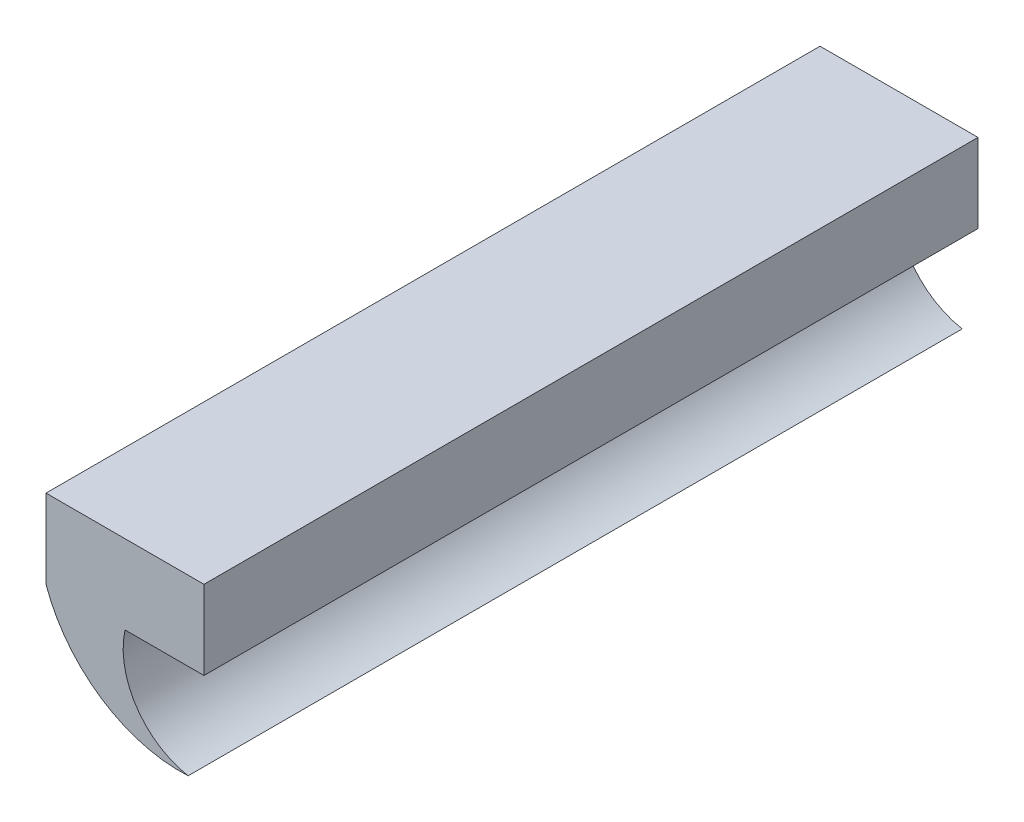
from build123d import *

# Parameters (mm, degrees)
SKETCH_1_W      = 2
SKETCH_1_H      = 1
EXTRUDE_1_DEPTH = 9.8
EXTRUDE_2_DEPTH = 9.8


with BuildPart() as part:
    # Sketch 1 → Extrude 1 (new body)
    with BuildSketch(Plane.XY):
        with Locations((1, 0.5)):
            Rectangle(SKETCH_1_W, SKETCH_1_H)
    extrude(amount=EXTRUDE_1_DEPTH)

    # Sketch 2 → Extrude 2 (add)
    with BuildSketch(Plane(origin=(0, 0, 0), x_dir=(-1, 0, 0), z_dir=(0, 0, -1))):
        with BuildLine():
            Line((0, 0), (-1, 0))
            ThreePointArc((-1, 0), (-1.144411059, -0.770392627), (-1.8, -1.2))
            ThreePointArc((-1.8, -1.2), (-0.699614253, -0.900578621), (0, 0))
        make_face()
    extrude(amount=-EXTRUDE_2_DEPTH)


solid = part.part
